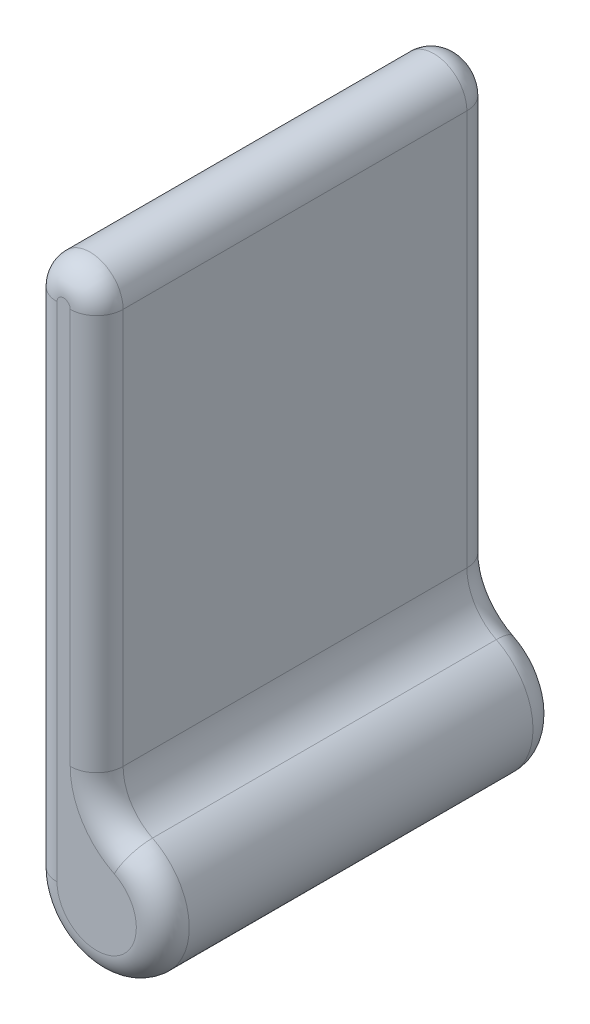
ISO-10303-21;
HEADER;
FILE_DESCRIPTION(('STEP AP214'),'2;1');
FILE_NAME('part.step','',(''),(''),'','','');
FILE_SCHEMA(('AUTOMOTIVE_DESIGN { 1 0 10303 214 1 1 1 1 }'));
ENDSEC;
DATA;
#1=APPLICATION_CONTEXT('core data for automotive mechanical design processes');
#2=APPLICATION_PROTOCOL_DEFINITION('international standard','automotive_design',2000,#1);
#3=PRODUCT_CONTEXT('',#1,'mechanical');
#4=PRODUCT('Part','Part','',(#3));
#5=PRODUCT_RELATED_PRODUCT_CATEGORY('part','',(#4));
#6=PRODUCT_DEFINITION_FORMATION('','',#4);
#7=PRODUCT_DEFINITION_CONTEXT('part definition',#1,'design');
#8=PRODUCT_DEFINITION('design','',#6,#7);
#9=PRODUCT_DEFINITION_SHAPE('','',#8);
#10=(LENGTH_UNIT() NAMED_UNIT(*) SI_UNIT(.MILLI.,.METRE.));
#11=(NAMED_UNIT(*) PLANE_ANGLE_UNIT() SI_UNIT($,.RADIAN.));
#12=(NAMED_UNIT(*) SI_UNIT($,.STERADIAN.) SOLID_ANGLE_UNIT());
#13=UNCERTAINTY_MEASURE_WITH_UNIT(LENGTH_MEASURE(1.E-05),#10,'distance_accuracy_value','');
#14=(GEOMETRIC_REPRESENTATION_CONTEXT(3) GLOBAL_UNCERTAINTY_ASSIGNED_CONTEXT((#13)) GLOBAL_UNIT_ASSIGNED_CONTEXT((#10,
#11,#12)) REPRESENTATION_CONTEXT('',''));
#15=CARTESIAN_POINT('',(0.,0.,0.));
#16=DIRECTION('',(0.,0.,1.));
#17=DIRECTION('',(1.,0.,0.));
#18=AXIS2_PLACEMENT_3D('',#15,#16,#17);
#19=CARTESIAN_POINT('',(0.8255,-3.80209326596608,3.81));
#20=DIRECTION('',(0.,0.,-1.));
#21=DIRECTION('',(-1.,0.,0.));
#22=AXIS2_PLACEMENT_3D('',#19,#20,#21);
#23=CYLINDRICAL_SURFACE('',#22,0.508);
#24=DIRECTION('',(0.,0.,-1.));
#25=VECTOR('',#24,1.);
#26=CARTESIAN_POINT('',(0.3175,-3.80209326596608,3.81));
#27=LINE('',#26,#25);
#28=CARTESIAN_POINT('',(0.3175,-3.80209326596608,3.556));
#29=VERTEX_POINT('',#28);
#30=CARTESIAN_POINT('',(0.3175,-3.80209326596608,0.254000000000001));
#31=VERTEX_POINT('',#30);
#32=EDGE_CURVE('E132',#29,#31,#27,.T.);
#33=ORIENTED_EDGE('',*,*,#32,.F.);
#34=CARTESIAN_POINT('',(0.8255,-3.80209326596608,3.556));
#35=DIRECTION('',(0.,0.,-1.));
#36=DIRECTION('',(-1.,0.,0.));
#37=AXIS2_PLACEMENT_3D('',#34,#35,#36);
#38=CIRCLE('',#37,0.508);
#39=CARTESIAN_POINT('',(0.599722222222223,-4.25716292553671,3.556));
#40=VERTEX_POINT('',#39);
#41=EDGE_CURVE('E119',#29,#40,#38,.F.);
#42=ORIENTED_EDGE('',*,*,#41,.T.);
#43=DIRECTION('',(0.,0.,-1.));
#44=VECTOR('',#43,1.);
#45=CARTESIAN_POINT('',(0.599722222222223,-4.25716292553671,3.81));
#46=LINE('',#45,#44);
#47=CARTESIAN_POINT('',(0.599722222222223,-4.25716292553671,0.254));
#48=VERTEX_POINT('',#47);
#49=EDGE_CURVE('E177',#40,#48,#46,.T.);
#50=ORIENTED_EDGE('',*,*,#49,.T.);
#51=CARTESIAN_POINT('',(0.8255,-3.80209326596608,0.254));
#52=DIRECTION('',(0.,0.,-1.));
#53=DIRECTION('',(-1.,0.,0.));
#54=AXIS2_PLACEMENT_3D('',#51,#52,#53);
#55=CIRCLE('',#54,0.508);
#56=EDGE_CURVE('E138',#48,#31,#55,.T.);
#57=ORIENTED_EDGE('',*,*,#56,.T.);
#58=EDGE_LOOP('',(#33,#42,#50,#57));
#59=FACE_BOUND('',#58,.T.);
#60=ADVANCED_FACE('F32',(#59),#23,.F.);
#61=CARTESIAN_POINT('',(0.3175,0.,3.81));
#62=DIRECTION('',(-1.,0.,0.));
#63=DIRECTION('',(0.,-1.,0.));
#64=AXIS2_PLACEMENT_3D('',#61,#62,#63);
#65=PLANE('',#64);
#66=ORIENTED_EDGE('',*,*,#32,.T.);
#67=DIRECTION('',(0.,1.,0.));
#68=VECTOR('',#67,1.);
#69=CARTESIAN_POINT('',(0.3175,0.,0.254));
#70=LINE('',#69,#68);
#71=CARTESIAN_POINT('',(0.3175,0.,0.254000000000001));
#72=VERTEX_POINT('',#71);
#73=EDGE_CURVE('E11',#31,#72,#70,.T.);
#74=ORIENTED_EDGE('',*,*,#73,.T.);
#75=DIRECTION('',(0.,0.,-1.));
#76=VECTOR('',#75,1.);
#77=CARTESIAN_POINT('',(0.3175,0.,3.81));
#78=LINE('',#77,#76);
#79=CARTESIAN_POINT('',(0.3175,0.,3.556));
#80=VERTEX_POINT('',#79);
#81=EDGE_CURVE('E202',#80,#72,#78,.T.);
#82=ORIENTED_EDGE('',*,*,#81,.F.);
#83=DIRECTION('',(0.,1.,0.));
#84=VECTOR('',#83,1.);
#85=CARTESIAN_POINT('',(0.3175,0.,3.556));
#86=LINE('',#85,#84);
#87=EDGE_CURVE('E41',#80,#29,#86,.F.);
#88=ORIENTED_EDGE('',*,*,#87,.T.);
#89=EDGE_LOOP('',(#66,#74,#82,#88));
#90=FACE_BOUND('',#89,.T.);
#91=ADVANCED_FACE('F201',(#90),#65,.F.);
#92=CARTESIAN_POINT('',(0.,0.,3.81));
#93=DIRECTION('',(0.,0.,-1.));
#94=DIRECTION('',(-1.,0.,0.));
#95=AXIS2_PLACEMENT_3D('',#92,#93,#94);
#96=CYLINDRICAL_SURFACE('',#95,0.3175);
#97=DIRECTION('',(0.,0.,-1.));
#98=VECTOR('',#97,1.);
#99=CARTESIAN_POINT('',(-0.3175,0.,3.81));
#100=LINE('',#99,#98);
#101=CARTESIAN_POINT('',(-0.3175,0.,3.556));
#102=VERTEX_POINT('',#101);
#103=CARTESIAN_POINT('',(-0.3175,0.,0.253999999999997));
#104=VERTEX_POINT('',#103);
#105=EDGE_CURVE('E209',#102,#104,#100,.T.);
#106=ORIENTED_EDGE('',*,*,#105,.F.);
#107=CARTESIAN_POINT('',(0.,0.,3.556));
#108=DIRECTION('',(0.,0.,-1.));
#109=DIRECTION('',(-1.,0.,0.));
#110=AXIS2_PLACEMENT_3D('',#107,#108,#109);
#111=CIRCLE('',#110,0.3175);
#112=EDGE_CURVE('E157',#102,#80,#111,.T.);
#113=ORIENTED_EDGE('',*,*,#112,.T.);
#114=ORIENTED_EDGE('',*,*,#81,.T.);
#115=CARTESIAN_POINT('',(0.,0.,0.253999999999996));
#116=DIRECTION('',(0.,0.,-1.));
#117=DIRECTION('',(-1.,0.,0.));
#118=AXIS2_PLACEMENT_3D('',#115,#116,#117);
#119=CIRCLE('',#118,0.3175);
#120=EDGE_CURVE('E155',#72,#104,#119,.F.);
#121=ORIENTED_EDGE('',*,*,#120,.T.);
#122=EDGE_LOOP('',(#106,#113,#114,#121));
#123=FACE_BOUND('',#122,.T.);
#124=ADVANCED_FACE('F206',(#123),#96,.T.);
#125=CARTESIAN_POINT('',(-0.3175,0.,3.81));
#126=DIRECTION('',(1.,0.,0.));
#127=DIRECTION('',(0.,1.,0.));
#128=AXIS2_PLACEMENT_3D('',#125,#126,#127);
#129=PLANE('',#128);
#130=DIRECTION('',(0.,0.,-1.));
#131=VECTOR('',#130,1.);
#132=CARTESIAN_POINT('',(-0.317499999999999,-4.826,3.81));
#133=LINE('',#132,#131);
#134=CARTESIAN_POINT('',(-0.317499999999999,-4.826,3.556));
#135=VERTEX_POINT('',#134);
#136=CARTESIAN_POINT('',(-0.317499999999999,-4.826,0.254));
#137=VERTEX_POINT('',#136);
#138=EDGE_CURVE('E212',#135,#137,#133,.T.);
#139=ORIENTED_EDGE('',*,*,#138,.F.);
#140=DIRECTION('',(0.,-1.,0.));
#141=VECTOR('',#140,1.);
#142=CARTESIAN_POINT('',(-0.3175,0.,3.556));
#143=LINE('',#142,#141);
#144=EDGE_CURVE('E153',#135,#102,#143,.F.);
#145=ORIENTED_EDGE('',*,*,#144,.T.);
#146=ORIENTED_EDGE('',*,*,#105,.T.);
#147=DIRECTION('',(0.,-1.,0.));
#148=VECTOR('',#147,1.);
#149=CARTESIAN_POINT('',(-0.3175,-4.826,0.254));
#150=LINE('',#149,#148);
#151=EDGE_CURVE('E150',#104,#137,#150,.T.);
#152=ORIENTED_EDGE('',*,*,#151,.T.);
#153=EDGE_LOOP('',(#139,#145,#146,#152));
#154=FACE_BOUND('',#153,.T.);
#155=ADVANCED_FACE('F235',(#154),#129,.F.);
#156=CARTESIAN_POINT('',(0.317500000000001,-4.826,3.81));
#157=DIRECTION('',(0.,0.,-1.));
#158=DIRECTION('',(-1.,0.,0.));
#159=AXIS2_PLACEMENT_3D('',#156,#157,#158);
#160=CYLINDRICAL_SURFACE('',#159,0.635);
#161=ORIENTED_EDGE('',*,*,#49,.F.);
#162=CARTESIAN_POINT('',(0.317500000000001,-4.826,3.556));
#163=DIRECTION('',(0.,0.,-1.));
#164=DIRECTION('',(-1.,0.,0.));
#165=AXIS2_PLACEMENT_3D('',#162,#163,#164);
#166=CIRCLE('',#165,0.635);
#167=EDGE_CURVE('E148',#40,#135,#166,.T.);
#168=ORIENTED_EDGE('',*,*,#167,.T.);
#169=ORIENTED_EDGE('',*,*,#138,.T.);
#170=CARTESIAN_POINT('',(0.317500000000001,-4.826,0.253999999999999));
#171=DIRECTION('',(0.,0.,-1.));
#172=DIRECTION('',(-1.,0.,0.));
#173=AXIS2_PLACEMENT_3D('',#170,#171,#172);
#174=CIRCLE('',#173,0.635);
#175=EDGE_CURVE('E146',#137,#48,#174,.F.);
#176=ORIENTED_EDGE('',*,*,#175,.T.);
#177=EDGE_LOOP('',(#161,#168,#169,#176));
#178=FACE_BOUND('',#177,.T.);
#179=ADVANCED_FACE('F231',(#178),#160,.T.);
#180=CARTESIAN_POINT('',(0.8255,-3.80209326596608,3.81));
#181=DIRECTION('',(0.,0.,-1.));
#182=DIRECTION('',(-1.,0.,0.));
#183=AXIS2_PLACEMENT_3D('',#180,#181,#182);
#184=PLANE('',#183);
#185=CARTESIAN_POINT('',(0.317500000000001,-4.826,3.81));
#186=DIRECTION('',(0.,0.,-1.));
#187=DIRECTION('',(-1.,0.,0.));
#188=AXIS2_PLACEMENT_3D('',#185,#186,#187);
#189=CIRCLE('',#188,0.381);
#190=CARTESIAN_POINT('',(-0.0634999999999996,-4.826,3.81));
#191=VERTEX_POINT('',#190);
#192=CARTESIAN_POINT('',(0.486833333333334,-4.48469775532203,3.81));
#193=VERTEX_POINT('',#192);
#194=EDGE_CURVE('E136',#191,#193,#189,.F.);
#195=ORIENTED_EDGE('',*,*,#194,.T.);
#196=CARTESIAN_POINT('',(0.8255,-3.80209326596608,3.81));
#197=DIRECTION('',(0.,0.,-1.));
#198=DIRECTION('',(-1.,0.,0.));
#199=AXIS2_PLACEMENT_3D('',#196,#197,#198);
#200=CIRCLE('',#199,0.762);
#201=CARTESIAN_POINT('',(0.0635000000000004,-3.80209326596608,3.81));
#202=VERTEX_POINT('',#201);
#203=EDGE_CURVE('E117',#193,#202,#200,.T.);
#204=ORIENTED_EDGE('',*,*,#203,.T.);
#205=DIRECTION('',(0.,1.,0.));
#206=VECTOR('',#205,1.);
#207=CARTESIAN_POINT('',(0.0635000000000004,-3.80209326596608,3.81));
#208=LINE('',#207,#206);
#209=CARTESIAN_POINT('',(0.0635,0.,3.81));
#210=VERTEX_POINT('',#209);
#211=EDGE_CURVE('E125',#202,#210,#208,.T.);
#212=ORIENTED_EDGE('',*,*,#211,.T.);
#213=CARTESIAN_POINT('',(0.,0.,3.81));
#214=DIRECTION('',(0.,0.,-1.));
#215=DIRECTION('',(-1.,0.,0.));
#216=AXIS2_PLACEMENT_3D('',#213,#214,#215);
#217=CIRCLE('',#216,0.0635);
#218=CARTESIAN_POINT('',(-0.0635,0.,3.81));
#219=VERTEX_POINT('',#218);
#220=EDGE_CURVE('E131',#210,#219,#217,.F.);
#221=ORIENTED_EDGE('',*,*,#220,.T.);
#222=DIRECTION('',(0.,-1.,0.));
#223=VECTOR('',#222,1.);
#224=CARTESIAN_POINT('',(-0.0634999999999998,-3.80209326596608,3.81));
#225=LINE('',#224,#223);
#226=EDGE_CURVE('E141',#219,#191,#225,.T.);
#227=ORIENTED_EDGE('',*,*,#226,.T.);
#228=EDGE_LOOP('',(#195,#204,#212,#221,#227));
#229=FACE_BOUND('',#228,.T.);
#230=ADVANCED_FACE('F134',(#229),#184,.F.);
#231=CARTESIAN_POINT('',(0.8255,-3.80209326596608,0.));
#232=DIRECTION('',(0.,0.,-1.));
#233=DIRECTION('',(-1.,0.,0.));
#234=AXIS2_PLACEMENT_3D('',#231,#232,#233);
#235=PLANE('',#234);
#236=CARTESIAN_POINT('',(0.317500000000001,-4.826,0.));
#237=DIRECTION('',(0.,0.,-1.));
#238=DIRECTION('',(-1.,0.,0.));
#239=AXIS2_PLACEMENT_3D('',#236,#237,#238);
#240=CIRCLE('',#239,0.381);
#241=CARTESIAN_POINT('',(0.486833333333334,-4.48469775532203,0.));
#242=VERTEX_POINT('',#241);
#243=CARTESIAN_POINT('',(-0.0634999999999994,-4.826,0.));
#244=VERTEX_POINT('',#243);
#245=EDGE_CURVE('E159',#242,#244,#240,.T.);
#246=ORIENTED_EDGE('',*,*,#245,.T.);
#247=DIRECTION('',(0.,-1.,0.));
#248=VECTOR('',#247,1.);
#249=CARTESIAN_POINT('',(-0.0635000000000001,0.,0.));
#250=LINE('',#249,#248);
#251=CARTESIAN_POINT('',(-0.0635,0.,0.));
#252=VERTEX_POINT('',#251);
#253=EDGE_CURVE('E166',#244,#252,#250,.F.);
#254=ORIENTED_EDGE('',*,*,#253,.T.);
#255=CARTESIAN_POINT('',(0.,0.,0.));
#256=DIRECTION('',(0.,0.,-1.));
#257=DIRECTION('',(-1.,0.,0.));
#258=AXIS2_PLACEMENT_3D('',#255,#256,#257);
#259=CIRCLE('',#258,0.0635);
#260=CARTESIAN_POINT('',(0.0635,0.,0.));
#261=VERTEX_POINT('',#260);
#262=EDGE_CURVE('E56',#252,#261,#259,.T.);
#263=ORIENTED_EDGE('',*,*,#262,.T.);
#264=DIRECTION('',(0.,1.,0.));
#265=VECTOR('',#264,1.);
#266=CARTESIAN_POINT('',(0.0635000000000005,-3.80209326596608,0.));
#267=LINE('',#266,#265);
#268=CARTESIAN_POINT('',(0.0635000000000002,-3.80209326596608,0.));
#269=VERTEX_POINT('',#268);
#270=EDGE_CURVE('E163',#261,#269,#267,.F.);
#271=ORIENTED_EDGE('',*,*,#270,.T.);
#272=CARTESIAN_POINT('',(0.8255,-3.80209326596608,0.));
#273=DIRECTION('',(0.,0.,-1.));
#274=DIRECTION('',(-1.,0.,0.));
#275=AXIS2_PLACEMENT_3D('',#272,#273,#274);
#276=CIRCLE('',#275,0.762);
#277=EDGE_CURVE('E161',#269,#242,#276,.F.);
#278=ORIENTED_EDGE('',*,*,#277,.T.);
#279=EDGE_LOOP('',(#246,#254,#263,#271,#278));
#280=FACE_BOUND('',#279,.T.);
#281=ADVANCED_FACE('F241',(#280),#235,.T.);
#282=CARTESIAN_POINT('',(-0.0634999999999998,-3.80209326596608,3.556));
#283=DIRECTION('',(0.,-1.,0.));
#284=DIRECTION('',(1.,0.,0.));
#285=AXIS2_PLACEMENT_3D('',#282,#283,#284);
#286=CYLINDRICAL_SURFACE('',#285,0.254);
#287=CARTESIAN_POINT('',(-0.0634999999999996,-4.826,3.556));
#288=DIRECTION('',(0.,-1.,0.));
#289=DIRECTION('',(0.,0.,-1.));
#290=AXIS2_PLACEMENT_3D('',#287,#288,#289);
#291=CIRCLE('',#290,0.254);
#292=EDGE_CURVE('E171',#191,#135,#291,.T.);
#293=ORIENTED_EDGE('',*,*,#292,.F.);
#294=ORIENTED_EDGE('',*,*,#226,.F.);
#295=CARTESIAN_POINT('',(-0.0635000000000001,0.,3.556));
#296=DIRECTION('',(0.,1.,0.));
#297=DIRECTION('',(-1.,0.,0.));
#298=AXIS2_PLACEMENT_3D('',#295,#296,#297);
#299=CIRCLE('',#298,0.254);
#300=EDGE_CURVE('E174',#102,#219,#299,.T.);
#301=ORIENTED_EDGE('',*,*,#300,.F.);
#302=ORIENTED_EDGE('',*,*,#144,.F.);
#303=EDGE_LOOP('',(#293,#294,#301,#302));
#304=FACE_BOUND('',#303,.T.);
#305=ADVANCED_FACE('F221',(#304),#286,.T.);
#306=CARTESIAN_POINT('',(0.,0.,3.556));
#307=DIRECTION('',(0.,0.,-1.));
#308=DIRECTION('',(-1.,0.,0.));
#309=AXIS2_PLACEMENT_3D('',#306,#307,#308);
#310=DEGENERATE_TOROIDAL_SURFACE('',#309,0.0635,0.254,.T.);
#311=ORIENTED_EDGE('',*,*,#300,.T.);
#312=ORIENTED_EDGE('',*,*,#220,.F.);
#313=CARTESIAN_POINT('',(0.0635,0.,3.556));
#314=DIRECTION('',(0.,-1.,0.));
#315=DIRECTION('',(1.,0.,0.));
#316=AXIS2_PLACEMENT_3D('',#313,#314,#315);
#317=CIRCLE('',#316,0.254);
#318=EDGE_CURVE('E128',#80,#210,#317,.T.);
#319=ORIENTED_EDGE('',*,*,#318,.F.);
#320=ORIENTED_EDGE('',*,*,#112,.F.);
#321=EDGE_LOOP('',(#311,#312,#319,#320));
#322=FACE_BOUND('',#321,.T.);
#323=ADVANCED_FACE('F248',(#322),#310,.T.);
#324=CARTESIAN_POINT('',(0.317500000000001,-4.826,3.556));
#325=DIRECTION('',(0.,0.,-1.));
#326=DIRECTION('',(-1.,0.,0.));
#327=AXIS2_PLACEMENT_3D('',#324,#325,#326);
#328=TOROIDAL_SURFACE('',#327,0.381,0.254);
#329=ORIENTED_EDGE('',*,*,#292,.T.);
#330=ORIENTED_EDGE('',*,*,#167,.F.);
#331=CARTESIAN_POINT('',(0.486833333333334,-4.48469775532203,3.556));
#332=DIRECTION('',(-0.895806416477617,0.444444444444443,0.));
#333=DIRECTION('',(-0.444444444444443,-0.895806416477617,0.));
#334=AXIS2_PLACEMENT_3D('',#331,#332,#333);
#335=CIRCLE('',#334,0.254);
#336=EDGE_CURVE('E122',#193,#40,#335,.T.);
#337=ORIENTED_EDGE('',*,*,#336,.F.);
#338=ORIENTED_EDGE('',*,*,#194,.F.);
#339=EDGE_LOOP('',(#329,#330,#337,#338));
#340=FACE_BOUND('',#339,.T.);
#341=ADVANCED_FACE('F224',(#340),#328,.T.);
#342=CARTESIAN_POINT('',(0.0635000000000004,-3.80209326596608,3.556));
#343=DIRECTION('',(0.,1.,0.));
#344=DIRECTION('',(-1.,0.,0.));
#345=AXIS2_PLACEMENT_3D('',#342,#343,#344);
#346=CYLINDRICAL_SURFACE('',#345,0.254);
#347=ORIENTED_EDGE('',*,*,#318,.T.);
#348=ORIENTED_EDGE('',*,*,#211,.F.);
#349=CARTESIAN_POINT('',(0.0635000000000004,-3.80209326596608,3.556));
#350=DIRECTION('',(0.,-1.,0.));
#351=DIRECTION('',(0.,0.,-1.));
#352=AXIS2_PLACEMENT_3D('',#349,#350,#351);
#353=CIRCLE('',#352,0.254);
#354=EDGE_CURVE('E113',#29,#202,#353,.T.);
#355=ORIENTED_EDGE('',*,*,#354,.F.);
#356=ORIENTED_EDGE('',*,*,#87,.F.);
#357=EDGE_LOOP('',(#347,#348,#355,#356));
#358=FACE_BOUND('',#357,.T.);
#359=ADVANCED_FACE('F126',(#358),#346,.T.);
#360=CARTESIAN_POINT('',(0.8255,-3.80209326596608,3.556));
#361=DIRECTION('',(0.,0.,-1.));
#362=DIRECTION('',(-1.,0.,0.));
#363=AXIS2_PLACEMENT_3D('',#360,#361,#362);
#364=TOROIDAL_SURFACE('',#363,0.762,0.254);
#365=ORIENTED_EDGE('',*,*,#336,.T.);
#366=ORIENTED_EDGE('',*,*,#41,.F.);
#367=ORIENTED_EDGE('',*,*,#354,.T.);
#368=ORIENTED_EDGE('',*,*,#203,.F.);
#369=EDGE_LOOP('',(#365,#366,#367,#368));
#370=FACE_BOUND('',#369,.T.);
#371=ADVANCED_FACE('F115',(#370),#364,.T.);
#372=CARTESIAN_POINT('',(0.0635,0.,0.254));
#373=DIRECTION('',(0.,-1.,0.));
#374=DIRECTION('',(1.,0.,0.));
#375=AXIS2_PLACEMENT_3D('',#372,#373,#374);
#376=CYLINDRICAL_SURFACE('',#375,0.254);
#377=CARTESIAN_POINT('',(0.0635,0.,0.254));
#378=DIRECTION('',(0.,1.,0.));
#379=DIRECTION('',(-1.,0.,0.));
#380=AXIS2_PLACEMENT_3D('',#377,#378,#379);
#381=CIRCLE('',#380,0.254);
#382=EDGE_CURVE('E183',#72,#261,#381,.T.);
#383=ORIENTED_EDGE('',*,*,#382,.F.);
#384=ORIENTED_EDGE('',*,*,#73,.F.);
#385=CARTESIAN_POINT('',(0.0635000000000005,-3.80209326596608,0.254));
#386=DIRECTION('',(0.,-1.,0.));
#387=DIRECTION('',(0.,0.,-1.));
#388=AXIS2_PLACEMENT_3D('',#385,#386,#387);
#389=CIRCLE('',#388,0.254);
#390=EDGE_CURVE('E36',#269,#31,#389,.T.);
#391=ORIENTED_EDGE('',*,*,#390,.F.);
#392=ORIENTED_EDGE('',*,*,#270,.F.);
#393=EDGE_LOOP('',(#383,#384,#391,#392));
#394=FACE_BOUND('',#393,.T.);
#395=ADVANCED_FACE('F34',(#394),#376,.T.);
#396=CARTESIAN_POINT('',(0.8255,-3.80209326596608,0.254));
#397=DIRECTION('',(0.,0.,-1.));
#398=DIRECTION('',(-1.,0.,0.));
#399=AXIS2_PLACEMENT_3D('',#396,#397,#398);
#400=TOROIDAL_SURFACE('',#399,0.762,0.254);
#401=ORIENTED_EDGE('',*,*,#390,.T.);
#402=ORIENTED_EDGE('',*,*,#56,.F.);
#403=CARTESIAN_POINT('',(0.486833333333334,-4.48469775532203,0.254));
#404=DIRECTION('',(0.895806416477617,-0.444444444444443,0.));
#405=DIRECTION('',(0.444444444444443,0.895806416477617,0.));
#406=AXIS2_PLACEMENT_3D('',#403,#404,#405);
#407=CIRCLE('',#406,0.254);
#408=EDGE_CURVE('E181',#242,#48,#407,.T.);
#409=ORIENTED_EDGE('',*,*,#408,.F.);
#410=ORIENTED_EDGE('',*,*,#277,.F.);
#411=EDGE_LOOP('',(#401,#402,#409,#410));
#412=FACE_BOUND('',#411,.T.);
#413=ADVANCED_FACE('F193',(#412),#400,.T.);
#414=CARTESIAN_POINT('',(0.,0.,0.254));
#415=DIRECTION('',(0.,0.,-1.));
#416=DIRECTION('',(-1.,0.,0.));
#417=AXIS2_PLACEMENT_3D('',#414,#415,#416);
#418=DEGENERATE_TOROIDAL_SURFACE('',#417,0.0635,0.254,.T.);
#419=ORIENTED_EDGE('',*,*,#382,.T.);
#420=ORIENTED_EDGE('',*,*,#262,.F.);
#421=CARTESIAN_POINT('',(-0.0635,0.,0.253999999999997));
#422=DIRECTION('',(0.,-1.,0.));
#423=DIRECTION('',(0.,0.,-1.));
#424=AXIS2_PLACEMENT_3D('',#421,#422,#423);
#425=CIRCLE('',#424,0.254);
#426=EDGE_CURVE('E49',#104,#252,#425,.T.);
#427=ORIENTED_EDGE('',*,*,#426,.F.);
#428=ORIENTED_EDGE('',*,*,#120,.F.);
#429=EDGE_LOOP('',(#419,#420,#427,#428));
#430=FACE_BOUND('',#429,.T.);
#431=ADVANCED_FACE('F273',(#430),#418,.T.);
#432=CARTESIAN_POINT('',(0.317500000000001,-4.826,0.254));
#433=DIRECTION('',(0.,0.,-1.));
#434=DIRECTION('',(-1.,0.,0.));
#435=AXIS2_PLACEMENT_3D('',#432,#433,#434);
#436=TOROIDAL_SURFACE('',#435,0.381,0.254);
#437=ORIENTED_EDGE('',*,*,#408,.T.);
#438=ORIENTED_EDGE('',*,*,#175,.F.);
#439=CARTESIAN_POINT('',(-0.0634999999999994,-4.826,0.254));
#440=DIRECTION('',(0.,1.,0.));
#441=DIRECTION('',(0.,0.,1.));
#442=AXIS2_PLACEMENT_3D('',#439,#440,#441);
#443=CIRCLE('',#442,0.254);
#444=EDGE_CURVE('E178',#244,#137,#443,.T.);
#445=ORIENTED_EDGE('',*,*,#444,.F.);
#446=ORIENTED_EDGE('',*,*,#245,.F.);
#447=EDGE_LOOP('',(#437,#438,#445,#446));
#448=FACE_BOUND('',#447,.T.);
#449=ADVANCED_FACE('F240',(#448),#436,.T.);
#450=CARTESIAN_POINT('',(-0.0635000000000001,0.,0.254));
#451=DIRECTION('',(0.,1.,0.));
#452=DIRECTION('',(-1.,0.,0.));
#453=AXIS2_PLACEMENT_3D('',#450,#451,#452);
#454=CYLINDRICAL_SURFACE('',#453,0.254);
#455=ORIENTED_EDGE('',*,*,#426,.T.);
#456=ORIENTED_EDGE('',*,*,#253,.F.);
#457=ORIENTED_EDGE('',*,*,#444,.T.);
#458=ORIENTED_EDGE('',*,*,#151,.F.);
#459=EDGE_LOOP('',(#455,#456,#457,#458));
#460=FACE_BOUND('',#459,.T.);
#461=ADVANCED_FACE('F236',(#460),#454,.T.);
#462=CLOSED_SHELL('',(#60,#91,#124,#155,#179,#230,#281,#305,#323,#341,#359,#371,#395,#413,#431,
#449,#461));
#463=MANIFOLD_SOLID_BREP('B2',#462);
#464=ADVANCED_BREP_SHAPE_REPRESENTATION('',(#18,#463),#14);
#465=SHAPE_DEFINITION_REPRESENTATION(#9,#464);
ENDSEC;
END-ISO-10303-21;
